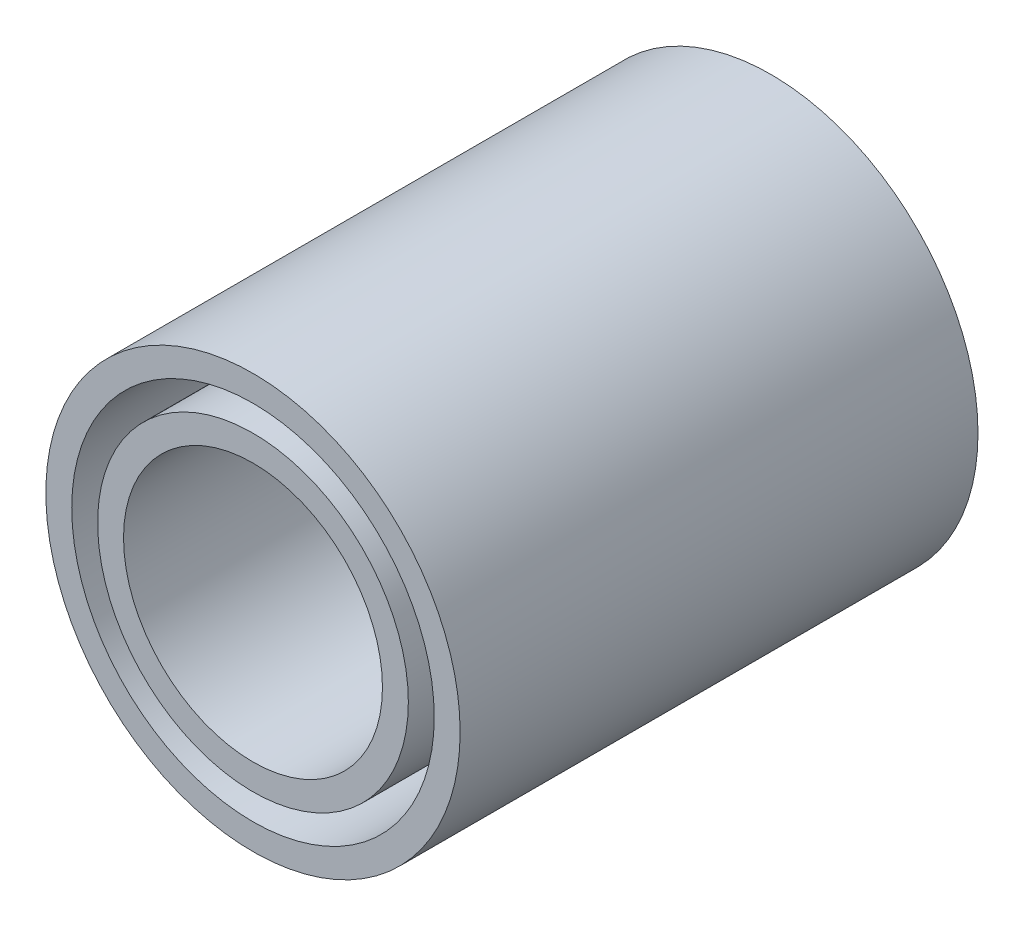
ISO-10303-21;
HEADER;
FILE_DESCRIPTION(('STEP AP214'),'2;1');
FILE_NAME('part.step','',(''),(''),'','','');
FILE_SCHEMA(('AUTOMOTIVE_DESIGN { 1 0 10303 214 1 1 1 1 }'));
ENDSEC;
DATA;
#1=APPLICATION_CONTEXT('core data for automotive mechanical design processes');
#2=APPLICATION_PROTOCOL_DEFINITION('international standard','automotive_design',2000,#1);
#3=PRODUCT_CONTEXT('',#1,'mechanical');
#4=PRODUCT('Part','Part','',(#3));
#5=PRODUCT_RELATED_PRODUCT_CATEGORY('part','',(#4));
#6=PRODUCT_DEFINITION_FORMATION('','',#4);
#7=PRODUCT_DEFINITION_CONTEXT('part definition',#1,'design');
#8=PRODUCT_DEFINITION('design','',#6,#7);
#9=PRODUCT_DEFINITION_SHAPE('','',#8);
#10=(LENGTH_UNIT() NAMED_UNIT(*) SI_UNIT(.MILLI.,.METRE.));
#11=(NAMED_UNIT(*) PLANE_ANGLE_UNIT() SI_UNIT($,.RADIAN.));
#12=(NAMED_UNIT(*) SI_UNIT($,.STERADIAN.) SOLID_ANGLE_UNIT());
#13=UNCERTAINTY_MEASURE_WITH_UNIT(LENGTH_MEASURE(1.E-05),#10,'distance_accuracy_value','');
#14=(GEOMETRIC_REPRESENTATION_CONTEXT(3) GLOBAL_UNCERTAINTY_ASSIGNED_CONTEXT((#13)) GLOBAL_UNIT_ASSIGNED_CONTEXT((#10,
#11,#12)) REPRESENTATION_CONTEXT('',''));
#15=CARTESIAN_POINT('',(0.,0.,0.));
#16=DIRECTION('',(0.,0.,1.));
#17=DIRECTION('',(1.,0.,0.));
#18=AXIS2_PLACEMENT_3D('',#15,#16,#17);
#19=CARTESIAN_POINT('',(0.,0.,-50.));
#20=DIRECTION('',(0.,0.,1.));
#21=DIRECTION('',(1.,0.,0.));
#22=AXIS2_PLACEMENT_3D('',#19,#20,#21);
#23=CYLINDRICAL_SURFACE('',#22,35.);
#24=CARTESIAN_POINT('',(0.,0.,-50.));
#25=DIRECTION('',(0.,0.,1.));
#26=DIRECTION('',(1.,0.,0.));
#27=AXIS2_PLACEMENT_3D('',#24,#25,#26);
#28=CIRCLE('',#27,35.);
#29=CARTESIAN_POINT('',(35.,0.,-50.));
#30=VERTEX_POINT('',#29);
#31=EDGE_CURVE('E54',#30,#30,#28,.T.);
#32=ORIENTED_EDGE('',*,*,#31,.F.);
#33=EDGE_LOOP('',(#32));
#34=FACE_BOUND('',#33,.T.);
#35=CARTESIAN_POINT('',(0.,0.,50.));
#36=DIRECTION('',(0.,0.,1.));
#37=DIRECTION('',(1.,0.,0.));
#38=AXIS2_PLACEMENT_3D('',#35,#36,#37);
#39=CIRCLE('',#38,35.);
#40=CARTESIAN_POINT('',(35.,0.,50.));
#41=VERTEX_POINT('',#40);
#42=EDGE_CURVE('E62',#41,#41,#39,.T.);
#43=ORIENTED_EDGE('',*,*,#42,.T.);
#44=EDGE_LOOP('',(#43));
#45=FACE_BOUND('',#44,.T.);
#46=ADVANCED_FACE('F48',(#34,#45),#23,.F.);
#47=CARTESIAN_POINT('',(0.,0.,-50.));
#48=DIRECTION('',(0.,0.,1.));
#49=DIRECTION('',(1.,0.,0.));
#50=AXIS2_PLACEMENT_3D('',#47,#48,#49);
#51=CYLINDRICAL_SURFACE('',#50,40.);
#52=CARTESIAN_POINT('',(0.,0.,-50.));
#53=DIRECTION('',(0.,0.,1.));
#54=DIRECTION('',(1.,0.,0.));
#55=AXIS2_PLACEMENT_3D('',#52,#53,#54);
#56=CIRCLE('',#55,40.);
#57=CARTESIAN_POINT('',(40.,0.,-50.));
#58=VERTEX_POINT('',#57);
#59=EDGE_CURVE('E12',#58,#58,#56,.T.);
#60=ORIENTED_EDGE('',*,*,#59,.T.);
#61=EDGE_LOOP('',(#60));
#62=FACE_BOUND('',#61,.T.);
#63=CARTESIAN_POINT('',(0.,0.,50.));
#64=DIRECTION('',(0.,0.,1.));
#65=DIRECTION('',(1.,0.,0.));
#66=AXIS2_PLACEMENT_3D('',#63,#64,#65);
#67=CIRCLE('',#66,40.);
#68=CARTESIAN_POINT('',(40.,0.,50.));
#69=VERTEX_POINT('',#68);
#70=EDGE_CURVE('E58',#69,#69,#67,.T.);
#71=ORIENTED_EDGE('',*,*,#70,.F.);
#72=EDGE_LOOP('',(#71));
#73=FACE_BOUND('',#72,.T.);
#74=ADVANCED_FACE('F76',(#62,#73),#51,.T.);
#75=CARTESIAN_POINT('',(0.,-88.1414213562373,-50.));
#76=DIRECTION('',(0.,0.,1.));
#77=DIRECTION('',(1.,0.,0.));
#78=AXIS2_PLACEMENT_3D('',#75,#76,#77);
#79=PLANE('',#78);
#80=ORIENTED_EDGE('',*,*,#31,.T.);
#81=EDGE_LOOP('',(#80));
#82=FACE_BOUND('',#81,.T.);
#83=ORIENTED_EDGE('',*,*,#59,.F.);
#84=EDGE_LOOP('',(#83));
#85=FACE_BOUND('',#84,.T.);
#86=ADVANCED_FACE('F72',(#82,#85),#79,.F.);
#87=CARTESIAN_POINT('',(0.,-88.1414213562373,50.));
#88=DIRECTION('',(0.,0.,1.));
#89=DIRECTION('',(1.,0.,0.));
#90=AXIS2_PLACEMENT_3D('',#87,#88,#89);
#91=PLANE('',#90);
#92=ORIENTED_EDGE('',*,*,#42,.F.);
#93=EDGE_LOOP('',(#92));
#94=FACE_BOUND('',#93,.T.);
#95=ORIENTED_EDGE('',*,*,#70,.T.);
#96=EDGE_LOOP('',(#95));
#97=FACE_BOUND('',#96,.T.);
#98=ADVANCED_FACE('F69',(#94,#97),#91,.T.);
#99=CLOSED_SHELL('',(#46,#74,#86,#98));
#100=MANIFOLD_SOLID_BREP('B2',#99);
#101=CARTESIAN_POINT('',(0.,0.,-50.));
#102=DIRECTION('',(0.,0.,1.));
#103=DIRECTION('',(1.,0.,0.));
#104=AXIS2_PLACEMENT_3D('',#101,#102,#103);
#105=CYLINDRICAL_SURFACE('',#104,25.);
#106=CARTESIAN_POINT('',(0.,0.,-50.));
#107=DIRECTION('',(0.,0.,1.));
#108=DIRECTION('',(1.,0.,0.));
#109=AXIS2_PLACEMENT_3D('',#106,#107,#108);
#110=CIRCLE('',#109,25.);
#111=CARTESIAN_POINT('',(25.,0.,-50.));
#112=VERTEX_POINT('',#111);
#113=EDGE_CURVE('E115',#112,#112,#110,.T.);
#114=ORIENTED_EDGE('',*,*,#113,.F.);
#115=EDGE_LOOP('',(#114));
#116=FACE_BOUND('',#115,.T.);
#117=CARTESIAN_POINT('',(0.,0.,50.));
#118=DIRECTION('',(0.,0.,1.));
#119=DIRECTION('',(1.,0.,0.));
#120=AXIS2_PLACEMENT_3D('',#117,#118,#119);
#121=CIRCLE('',#120,25.);
#122=CARTESIAN_POINT('',(25.,0.,50.));
#123=VERTEX_POINT('',#122);
#124=EDGE_CURVE('E123',#123,#123,#121,.T.);
#125=ORIENTED_EDGE('',*,*,#124,.T.);
#126=EDGE_LOOP('',(#125));
#127=FACE_BOUND('',#126,.T.);
#128=ADVANCED_FACE('F109',(#116,#127),#105,.F.);
#129=CARTESIAN_POINT('',(0.,0.,-50.));
#130=DIRECTION('',(0.,0.,1.));
#131=DIRECTION('',(1.,0.,0.));
#132=AXIS2_PLACEMENT_3D('',#129,#130,#131);
#133=CYLINDRICAL_SURFACE('',#132,30.);
#134=CARTESIAN_POINT('',(0.,0.,-50.));
#135=DIRECTION('',(0.,0.,1.));
#136=DIRECTION('',(1.,0.,0.));
#137=AXIS2_PLACEMENT_3D('',#134,#135,#136);
#138=CIRCLE('',#137,30.);
#139=CARTESIAN_POINT('',(30.,0.,-50.));
#140=VERTEX_POINT('',#139);
#141=EDGE_CURVE('E47',#140,#140,#138,.T.);
#142=ORIENTED_EDGE('',*,*,#141,.T.);
#143=EDGE_LOOP('',(#142));
#144=FACE_BOUND('',#143,.T.);
#145=CARTESIAN_POINT('',(0.,0.,50.));
#146=DIRECTION('',(0.,0.,1.));
#147=DIRECTION('',(1.,0.,0.));
#148=AXIS2_PLACEMENT_3D('',#145,#146,#147);
#149=CIRCLE('',#148,30.);
#150=CARTESIAN_POINT('',(30.,0.,50.));
#151=VERTEX_POINT('',#150);
#152=EDGE_CURVE('E119',#151,#151,#149,.T.);
#153=ORIENTED_EDGE('',*,*,#152,.F.);
#154=EDGE_LOOP('',(#153));
#155=FACE_BOUND('',#154,.T.);
#156=ADVANCED_FACE('F137',(#144,#155),#133,.T.);
#157=CARTESIAN_POINT('',(0.,-88.1414213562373,-50.));
#158=DIRECTION('',(0.,0.,1.));
#159=DIRECTION('',(1.,0.,0.));
#160=AXIS2_PLACEMENT_3D('',#157,#158,#159);
#161=PLANE('',#160);
#162=ORIENTED_EDGE('',*,*,#113,.T.);
#163=EDGE_LOOP('',(#162));
#164=FACE_BOUND('',#163,.T.);
#165=ORIENTED_EDGE('',*,*,#141,.F.);
#166=EDGE_LOOP('',(#165));
#167=FACE_BOUND('',#166,.T.);
#168=ADVANCED_FACE('F133',(#164,#167),#161,.F.);
#169=CARTESIAN_POINT('',(0.,-88.1414213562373,50.));
#170=DIRECTION('',(0.,0.,1.));
#171=DIRECTION('',(1.,0.,0.));
#172=AXIS2_PLACEMENT_3D('',#169,#170,#171);
#173=PLANE('',#172);
#174=ORIENTED_EDGE('',*,*,#124,.F.);
#175=EDGE_LOOP('',(#174));
#176=FACE_BOUND('',#175,.T.);
#177=ORIENTED_EDGE('',*,*,#152,.T.);
#178=EDGE_LOOP('',(#177));
#179=FACE_BOUND('',#178,.T.);
#180=ADVANCED_FACE('F130',(#176,#179),#173,.T.);
#181=CLOSED_SHELL('',(#128,#156,#168,#180));
#182=MANIFOLD_SOLID_BREP('B7',#181);
#183=ADVANCED_BREP_SHAPE_REPRESENTATION('',(#18,#100,#182),#14);
#184=SHAPE_DEFINITION_REPRESENTATION(#9,#183);
ENDSEC;
END-ISO-10303-21;
